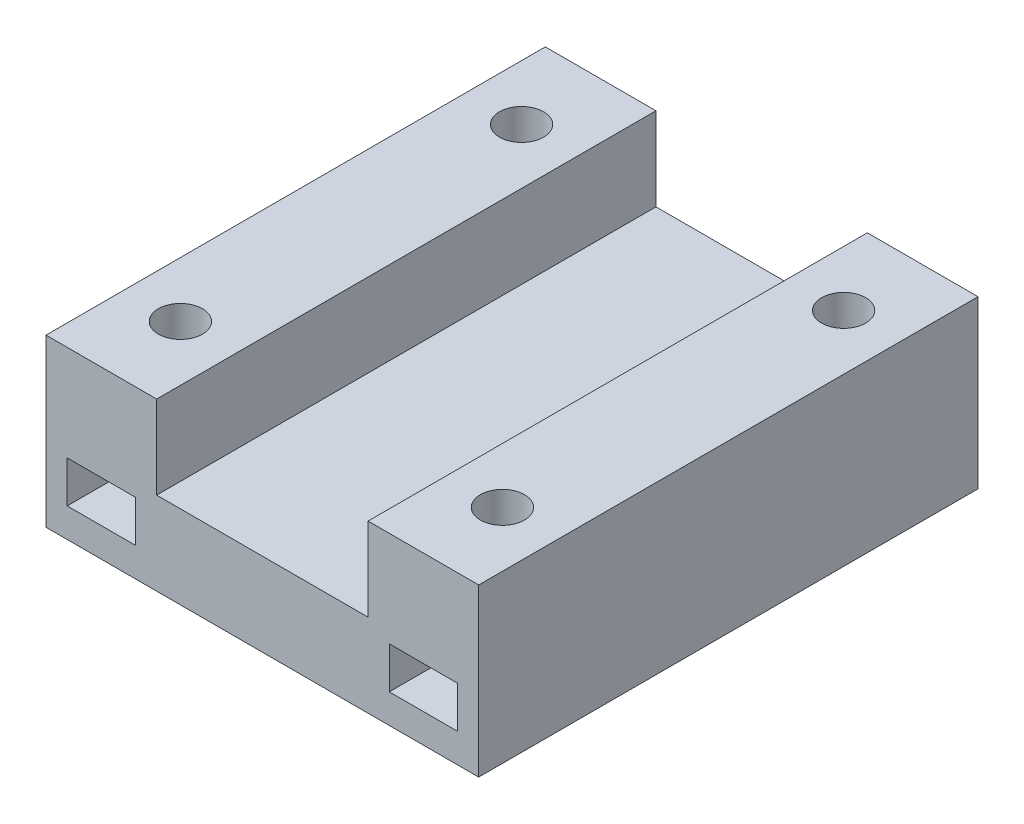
from build123d import *

# Parameters (mm, degrees)
SKETCH_1_W            = 75
SKETCH_1_H            = 55
SKETCH_1_R            = 2.65
EXTRUDE_1_DEPTH       = 20
SKETCH_2_W            = 52
SKETCH_2_H            = 55
EXTRUDE_2_DEPTH       = 40
CUT_EXTRUDE_1_DEPTH   = 92.588754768
EXTRUDE_3_DEPTH       = 10
SKETCH_5_R            = 2.65
CUT_EXTRUDE_2_DEPTH   = 30
SKETCH_6_W            = 8.2
SKETCH_6_H            = 5
CUT_EXTRUDE_3_DEPTH   = 13
SKETCH_8_W            = 8.2
SKETCH_8_H            = 5
CUT_EXTRUDE_4_DEPTH   = 13
CUT_EXTRUDE_5_DEPTH   = 4.2
CHAMFER_1_SIZE        = 11.5
SKETCH_11_OUTSIDE_W   = 100.194
SKETCH_11_OUTSIDE_H   = 90.194
SKETCH_11_OUTSIDE_W_2 = 52
SKETCH_11_OUTSIDE_H_2 = 20
CUT_EXTRUDE_6_DEPTH   = 81.07808689
SKETCH_13_R           = 2.05
CUT_EXTRUDE_8_DEPTH   = 5


with BuildPart() as part:
    # Sketch 1 → Extrude 1 (new body)
    with BuildSketch(Plane.XY):
        Rectangle(SKETCH_1_W, SKETCH_1_H)
        with Locations((-32, 15.25)):
            Circle(SKETCH_1_R, mode=Mode.SUBTRACT)
        with Locations((32, 15.25)):
            Circle(SKETCH_1_R, mode=Mode.SUBTRACT)
        with Locations((32, -15.25)):
            Circle(SKETCH_1_R, mode=Mode.SUBTRACT)
        with Locations((-32, -15.25)):
            Circle(SKETCH_1_R, mode=Mode.SUBTRACT)
    extrude(amount=EXTRUDE_1_DEPTH)

    # Sketch 2 → Extrude 2 (add)
    with BuildSketch(Plane.XY.offset(20)):
        Rectangle(SKETCH_2_W, SKETCH_2_H)
    extrude(amount=EXTRUDE_2_DEPTH)

    # Sketch 3 → Cut-Extrude 1 (cut, through all)
    with BuildSketch(Plane.ZY.offset(26)):
        Polygon((60, 17.5), (20, -27.5), (60, -27.5), align=None)
    extrude(amount=-CUT_EXTRUDE_1_DEPTH, mode=Mode.SUBTRACT)

    # Sketch 4 → Extrude 3 (add)
    with BuildSketch(Plane(origin=(0, 27.5, 0), x_dir=(1, 0, 0), z_dir=(0, 1, 0))):
        Polygon((-12.7, -60), (-12.7, 0), (-37.5, 0), (-37.5, -20), (-26, -20), (-26, -60), align=None)
        Polygon((12.7, -60), (12.7, 0), (37.5, 0), (37.5, -20), (26, -20), (26, -60), align=None)
    extrude(amount=EXTRUDE_3_DEPTH)

    # Sketch 5 → Cut-Extrude 2 (cut)
    with BuildSketch(Plane(origin=(0, 37.5, 0), x_dir=(1, 0, 0), z_dir=(0, 1, 0))):
        with Locations(Location((19.35, -50.5, 0), (0, 0, 180))):
            Circle(SKETCH_5_R)
        with Locations(Location((19.35, -9.5, 0), (0, 0, 180))):
            Circle(SKETCH_5_R)
        with Locations((-19.35, -9.5)):
            Circle(SKETCH_5_R)
        with Locations(Location((-19.35, -50.5, 0), (0, 0, 193.332867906))):
            Circle(SKETCH_5_R)
    extrude(amount=-CUT_EXTRUDE_2_DEPTH, mode=Mode.SUBTRACT)

    # Sketch 6 → Cut-Extrude 3 (cut)
    with BuildSketch(Plane(origin=(0, 0, 0), x_dir=(-1, 0, 0), z_dir=(0, 0, -1))):
        with Locations((-19.35, 23.5)):
            Rectangle(SKETCH_6_W, SKETCH_6_H)
        with Locations((19.35, 23.5)):
            Rectangle(SKETCH_6_W, SKETCH_6_H)
    extrude(amount=-CUT_EXTRUDE_3_DEPTH, mode=Mode.SUBTRACT)

    # Sketch 8 → Cut-Extrude 4 (cut)
    with BuildSketch(Plane.XY.offset(60)):
        with Locations((19.35, 23.5)):
            Rectangle(SKETCH_8_W, SKETCH_8_H)
        with Locations((-19.35, 23.5)):
            Rectangle(SKETCH_8_W, SKETCH_8_H)
    extrude(amount=-CUT_EXTRUDE_4_DEPTH, mode=Mode.SUBTRACT)

    # Sketch 10 → Cut-Extrude 5 (cut)
    with BuildSketch(Plane(origin=(0, 21, 0), x_dir=(1, 0, 0), z_dir=(0, 1, 0))):
        Polygon((23.45, -7.132863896), (19.35, -4.765727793), (15.25, -7.132863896), (15.25, -11.867136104), (19.35, -14.234272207), (23.45, -11.867136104), align=None)
        Polygon((23.45, -48.132863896), (19.35, -45.765727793), (15.25, -48.132863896), (15.25, -52.867136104), (19.35, -55.234272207), (23.45, -52.867136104), align=None)
        Polygon((-23.45, -52.867136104), (-23.45, -48.132863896), (-19.35, -45.765727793), (-15.25, -48.132863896), (-15.25, -52.867136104), (-19.35, -55.234272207), align=None)
        Polygon((-23.45, -11.867136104), (-23.45, -7.132863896), (-19.35, -4.765727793), (-15.25, -7.132863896), (-15.25, -11.867136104), (-19.35, -14.234272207), align=None)
    extrude(amount=CUT_EXTRUDE_5_DEPTH, mode=Mode.SUBTRACT)

    # Chamfer 1
    chamfer_1_edges = [part.edges().sort_by_distance(p)[0] for p in [
        (37.5, 37.5, 10),
        (-37.5, 37.5, 10),
    ]]
    chamfer(chamfer_1_edges, length=CHAMFER_1_SIZE)

    # Sketch 11 outside → Cut-Extrude 6 (cut, through all)
    with BuildSketch(Plane.XY.offset(60)):
        with Locations((0, 5)):
            Rectangle(SKETCH_11_OUTSIDE_W, SKETCH_11_OUTSIDE_H)
        with Locations((0, 27.5)):
            Rectangle(SKETCH_11_OUTSIDE_W_2, SKETCH_11_OUTSIDE_H_2, mode=Mode.SUBTRACT)
    extrude(amount=-CUT_EXTRUDE_6_DEPTH, mode=Mode.SUBTRACT)

    # Sketch 13 → Cut-Extrude 8 (cut)
    with BuildSketch(Plane.XZ.offset(-17.5)):
        with Locations(Location((-8.5, 53, 0), (0, 0, 270))):
            Circle(SKETCH_13_R)
        with Locations(Location((12.7, 40, 0), (0, 0, 270))):
            Circle(SKETCH_13_R)
        with Locations(Location((12.7, 20, 0), (0, 0, 270))):
            Circle(SKETCH_13_R)
        with Locations(Location((-8.5, 30, 0), (0, 0, 270))):
            Circle(SKETCH_13_R)
        with Locations(Location((-8.5, 7, 0), (0, 0, 270))):
            Circle(SKETCH_13_R)
    extrude(amount=-CUT_EXTRUDE_8_DEPTH, mode=Mode.SUBTRACT)


solid = part.part
